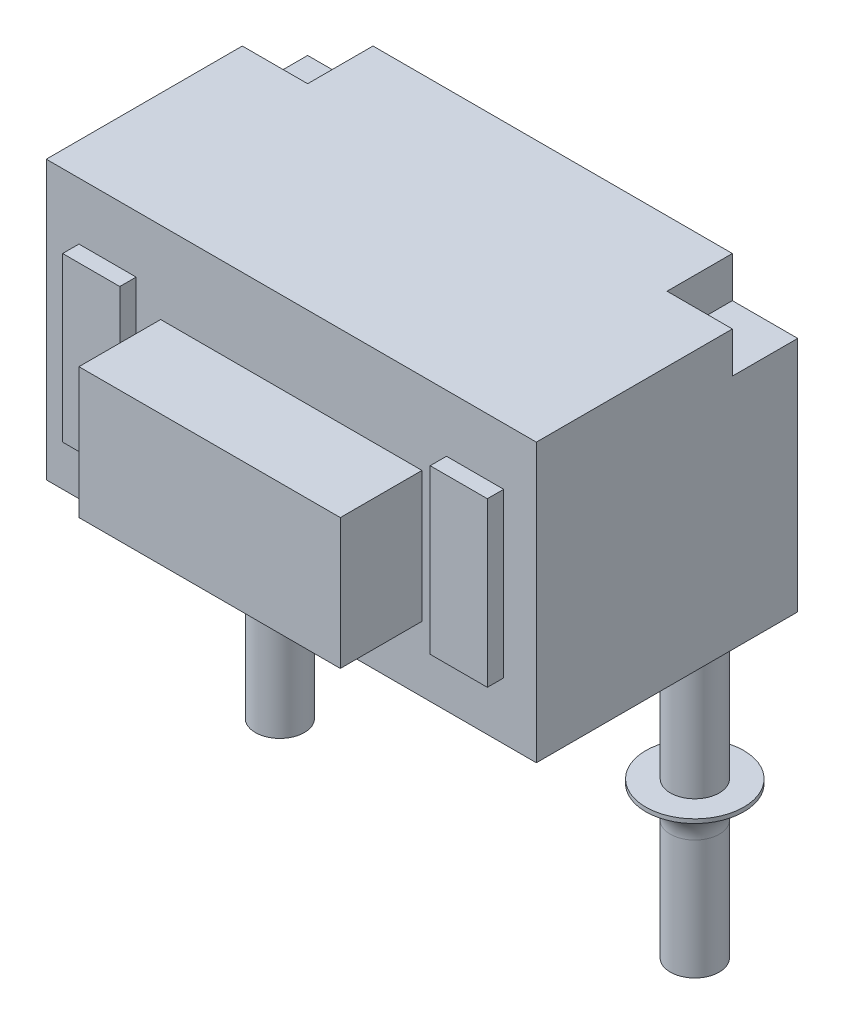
ISO-10303-21;
HEADER;
FILE_DESCRIPTION(('STEP AP214'),'2;1');
FILE_NAME('part.step','',(''),(''),'','','');
FILE_SCHEMA(('AUTOMOTIVE_DESIGN { 1 0 10303 214 1 1 1 1 }'));
ENDSEC;
DATA;
#1=APPLICATION_CONTEXT('core data for automotive mechanical design processes');
#2=APPLICATION_PROTOCOL_DEFINITION('international standard','automotive_design',2000,#1);
#3=PRODUCT_CONTEXT('',#1,'mechanical');
#4=PRODUCT('Part','Part','',(#3));
#5=PRODUCT_RELATED_PRODUCT_CATEGORY('part','',(#4));
#6=PRODUCT_DEFINITION_FORMATION('','',#4);
#7=PRODUCT_DEFINITION_CONTEXT('part definition',#1,'design');
#8=PRODUCT_DEFINITION('design','',#6,#7);
#9=PRODUCT_DEFINITION_SHAPE('','',#8);
#10=(LENGTH_UNIT() NAMED_UNIT(*) SI_UNIT(.MILLI.,.METRE.));
#11=(NAMED_UNIT(*) PLANE_ANGLE_UNIT() SI_UNIT($,.RADIAN.));
#12=(NAMED_UNIT(*) SI_UNIT($,.STERADIAN.) SOLID_ANGLE_UNIT());
#13=UNCERTAINTY_MEASURE_WITH_UNIT(LENGTH_MEASURE(1.E-05),#10,'distance_accuracy_value','');
#14=(GEOMETRIC_REPRESENTATION_CONTEXT(3) GLOBAL_UNCERTAINTY_ASSIGNED_CONTEXT((#13)) GLOBAL_UNIT_ASSIGNED_CONTEXT((#10,
#11,#12)) REPRESENTATION_CONTEXT('',''));
#15=CARTESIAN_POINT('',(0.,0.,0.));
#16=DIRECTION('',(0.,0.,1.));
#17=DIRECTION('',(1.,0.,0.));
#18=AXIS2_PLACEMENT_3D('',#15,#16,#17);
#19=CARTESIAN_POINT('',(-2.54,-3.5,-0.799999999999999));
#20=DIRECTION('',(0.,1.,0.));
#21=DIRECTION('',(0.,0.,1.));
#22=AXIS2_PLACEMENT_3D('',#19,#20,#21);
#23=CYLINDRICAL_SURFACE('',#22,0.3);
#24=CARTESIAN_POINT('',(-2.54,0.,-0.799999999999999));
#25=DIRECTION('',(0.,-1.,0.));
#26=DIRECTION('',(0.,0.,-1.));
#27=AXIS2_PLACEMENT_3D('',#24,#25,#26);
#28=CIRCLE('',#27,0.3);
#29=CARTESIAN_POINT('',(-2.54,0.,-1.1));
#30=VERTEX_POINT('',#29);
#31=EDGE_CURVE('E211',#30,#30,#28,.T.);
#32=ORIENTED_EDGE('',*,*,#31,.T.);
#33=EDGE_LOOP('',(#32));
#34=FACE_BOUND('',#33,.T.);
#35=CARTESIAN_POINT('',(-2.54,-1.6,-0.799999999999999));
#36=DIRECTION('',(0.,-1.,0.));
#37=DIRECTION('',(0.,0.,-1.));
#38=AXIS2_PLACEMENT_3D('',#35,#36,#37);
#39=CIRCLE('',#38,0.3);
#40=CARTESIAN_POINT('',(-2.54,-1.6,-1.1));
#41=VERTEX_POINT('',#40);
#42=EDGE_CURVE('E371',#41,#41,#39,.T.);
#43=ORIENTED_EDGE('',*,*,#42,.F.);
#44=EDGE_LOOP('',(#43));
#45=FACE_BOUND('',#44,.T.);
#46=ADVANCED_FACE('F35',(#34,#45),#23,.T.);
#47=CARTESIAN_POINT('',(2.54,-3.5,-0.799999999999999));
#48=DIRECTION('',(0.,1.,0.));
#49=DIRECTION('',(0.,0.,1.));
#50=AXIS2_PLACEMENT_3D('',#47,#48,#49);
#51=CYLINDRICAL_SURFACE('',#50,0.3);
#52=CARTESIAN_POINT('',(2.54,0.,-0.799999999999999));
#53=DIRECTION('',(0.,-1.,0.));
#54=DIRECTION('',(0.,0.,-1.));
#55=AXIS2_PLACEMENT_3D('',#52,#53,#54);
#56=CIRCLE('',#55,0.3);
#57=CARTESIAN_POINT('',(2.54,0.,-1.1));
#58=VERTEX_POINT('',#57);
#59=EDGE_CURVE('E552',#58,#58,#56,.T.);
#60=ORIENTED_EDGE('',*,*,#59,.T.);
#61=EDGE_LOOP('',(#60));
#62=FACE_BOUND('',#61,.T.);
#63=CARTESIAN_POINT('',(2.54,-1.6,-0.799999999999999));
#64=DIRECTION('',(0.,-1.,0.));
#65=DIRECTION('',(0.,0.,-1.));
#66=AXIS2_PLACEMENT_3D('',#63,#64,#65);
#67=CIRCLE('',#66,0.3);
#68=CARTESIAN_POINT('',(2.54,-1.6,-1.1));
#69=VERTEX_POINT('',#68);
#70=EDGE_CURVE('E368',#69,#69,#67,.T.);
#71=ORIENTED_EDGE('',*,*,#70,.F.);
#72=EDGE_LOOP('',(#71));
#73=FACE_BOUND('',#72,.T.);
#74=ADVANCED_FACE('F394',(#62,#73),#51,.T.);
#75=CARTESIAN_POINT('',(0.,0.,0.));
#76=DIRECTION('',(0.,-1.,0.));
#77=DIRECTION('',(0.,0.,-1.));
#78=AXIS2_PLACEMENT_3D('',#75,#76,#77);
#79=PLANE('',#78);
#80=ORIENTED_EDGE('',*,*,#31,.F.);
#81=EDGE_LOOP('',(#80));
#82=FACE_BOUND('',#81,.T.);
#83=DIRECTION('',(0.,0.,-1.));
#84=VECTOR('',#83,1.);
#85=CARTESIAN_POINT('',(3.,0.,1.6));
#86=LINE('',#85,#84);
#87=CARTESIAN_POINT('',(3.,0.,1.6));
#88=VERTEX_POINT('',#87);
#89=CARTESIAN_POINT('',(3.,0.,-1.6));
#90=VERTEX_POINT('',#89);
#91=EDGE_CURVE('E336',#88,#90,#86,.T.);
#92=ORIENTED_EDGE('',*,*,#91,.F.);
#93=DIRECTION('',(1.,0.,0.));
#94=VECTOR('',#93,1.);
#95=CARTESIAN_POINT('',(-3.,0.,1.6));
#96=LINE('',#95,#94);
#97=CARTESIAN_POINT('',(-3.,0.,1.6));
#98=VERTEX_POINT('',#97);
#99=EDGE_CURVE('E344',#98,#88,#96,.T.);
#100=ORIENTED_EDGE('',*,*,#99,.F.);
#101=DIRECTION('',(0.,0.,1.));
#102=VECTOR('',#101,1.);
#103=CARTESIAN_POINT('',(-3.,0.,1.6));
#104=LINE('',#103,#102);
#105=CARTESIAN_POINT('',(-3.,0.,-1.6));
#106=VERTEX_POINT('',#105);
#107=EDGE_CURVE('E356',#106,#98,#104,.T.);
#108=ORIENTED_EDGE('',*,*,#107,.F.);
#109=DIRECTION('',(-1.,0.,0.));
#110=VECTOR('',#109,1.);
#111=CARTESIAN_POINT('',(-3.,0.,-1.6));
#112=LINE('',#111,#110);
#113=EDGE_CURVE('E353',#90,#106,#112,.T.);
#114=ORIENTED_EDGE('',*,*,#113,.F.);
#115=EDGE_LOOP('',(#92,#100,#108,#114));
#116=FACE_BOUND('',#115,.T.);
#117=ORIENTED_EDGE('',*,*,#59,.F.);
#118=EDGE_LOOP('',(#117));
#119=FACE_BOUND('',#118,.T.);
#120=ADVANCED_FACE('F399',(#82,#116,#119),#79,.T.);
#121=CARTESIAN_POINT('',(-3.,3.4,1.6));
#122=DIRECTION('',(0.,0.,-1.));
#123=DIRECTION('',(-1.,0.,0.));
#124=AXIS2_PLACEMENT_3D('',#121,#122,#123);
#125=PLANE('',#124);
#126=DIRECTION('',(0.,-1.,0.));
#127=VECTOR('',#126,1.);
#128=CARTESIAN_POINT('',(-1.6,2.4,1.6));
#129=LINE('',#128,#127);
#130=CARTESIAN_POINT('',(-1.6,2.4,1.6));
#131=VERTEX_POINT('',#130);
#132=CARTESIAN_POINT('',(-1.6,0.8,1.6));
#133=VERTEX_POINT('',#132);
#134=EDGE_CURVE('E245',#131,#133,#129,.T.);
#135=ORIENTED_EDGE('',*,*,#134,.F.);
#136=DIRECTION('',(-1.,0.,0.));
#137=VECTOR('',#136,1.);
#138=CARTESIAN_POINT('',(-1.6,2.4,1.6));
#139=LINE('',#138,#137);
#140=CARTESIAN_POINT('',(1.6,2.4,1.6));
#141=VERTEX_POINT('',#140);
#142=EDGE_CURVE('E189',#141,#131,#139,.T.);
#143=ORIENTED_EDGE('',*,*,#142,.F.);
#144=DIRECTION('',(0.,1.,0.));
#145=VECTOR('',#144,1.);
#146=CARTESIAN_POINT('',(1.6,2.4,1.6));
#147=LINE('',#146,#145);
#148=CARTESIAN_POINT('',(1.6,0.8,1.6));
#149=VERTEX_POINT('',#148);
#150=EDGE_CURVE('E250',#149,#141,#147,.T.);
#151=ORIENTED_EDGE('',*,*,#150,.F.);
#152=DIRECTION('',(1.,0.,0.));
#153=VECTOR('',#152,1.);
#154=CARTESIAN_POINT('',(-1.6,0.8,1.6));
#155=LINE('',#154,#153);
#156=EDGE_CURVE('E247',#133,#149,#155,.T.);
#157=ORIENTED_EDGE('',*,*,#156,.F.);
#158=EDGE_LOOP('',(#135,#143,#151,#157));
#159=FACE_BOUND('',#158,.T.);
#160=ORIENTED_EDGE('',*,*,#99,.T.);
#161=DIRECTION('',(0.,-1.,0.));
#162=VECTOR('',#161,1.);
#163=CARTESIAN_POINT('',(3.,3.4,1.6));
#164=LINE('',#163,#162);
#165=CARTESIAN_POINT('',(3.,3.4,1.6));
#166=VERTEX_POINT('',#165);
#167=EDGE_CURVE('E350',#166,#88,#164,.T.);
#168=ORIENTED_EDGE('',*,*,#167,.F.);
#169=DIRECTION('',(1.,0.,0.));
#170=VECTOR('',#169,1.);
#171=CARTESIAN_POINT('',(-3.,3.4,1.6));
#172=LINE('',#171,#170);
#173=CARTESIAN_POINT('',(-3.,3.4,1.6));
#174=VERTEX_POINT('',#173);
#175=EDGE_CURVE('E348',#174,#166,#172,.T.);
#176=ORIENTED_EDGE('',*,*,#175,.F.);
#177=DIRECTION('',(0.,-1.,0.));
#178=VECTOR('',#177,1.);
#179=CARTESIAN_POINT('',(-3.,3.4,1.6));
#180=LINE('',#179,#178);
#181=EDGE_CURVE('E361',#174,#98,#180,.T.);
#182=ORIENTED_EDGE('',*,*,#181,.T.);
#183=EDGE_LOOP('',(#160,#168,#176,#182));
#184=FACE_BOUND('',#183,.T.);
#185=DIRECTION('',(0.,-1.,0.));
#186=VECTOR('',#185,1.);
#187=CARTESIAN_POINT('',(-2.6,2.7,1.6));
#188=LINE('',#187,#186);
#189=CARTESIAN_POINT('',(-2.6,2.7,1.6));
#190=VERTEX_POINT('',#189);
#191=CARTESIAN_POINT('',(-2.6,0.7,1.6));
#192=VERTEX_POINT('',#191);
#193=EDGE_CURVE('E259',#190,#192,#188,.T.);
#194=ORIENTED_EDGE('',*,*,#193,.F.);
#195=DIRECTION('',(-1.,0.,0.));
#196=VECTOR('',#195,1.);
#197=CARTESIAN_POINT('',(-2.6,2.7,1.6));
#198=LINE('',#197,#196);
#199=CARTESIAN_POINT('',(-1.9,2.7,1.6));
#200=VERTEX_POINT('',#199);
#201=EDGE_CURVE('E264',#200,#190,#198,.T.);
#202=ORIENTED_EDGE('',*,*,#201,.F.);
#203=DIRECTION('',(0.,1.,0.));
#204=VECTOR('',#203,1.);
#205=CARTESIAN_POINT('',(-1.9,2.7,1.6));
#206=LINE('',#205,#204);
#207=CARTESIAN_POINT('',(-1.9,0.7,1.6));
#208=VERTEX_POINT('',#207);
#209=EDGE_CURVE('E276',#208,#200,#206,.T.);
#210=ORIENTED_EDGE('',*,*,#209,.F.);
#211=DIRECTION('',(1.,0.,0.));
#212=VECTOR('',#211,1.);
#213=CARTESIAN_POINT('',(-2.6,0.7,1.6));
#214=LINE('',#213,#212);
#215=EDGE_CURVE('E273',#192,#208,#214,.T.);
#216=ORIENTED_EDGE('',*,*,#215,.F.);
#217=EDGE_LOOP('',(#194,#202,#210,#216));
#218=FACE_BOUND('',#217,.T.);
#219=DIRECTION('',(0.,-1.,0.));
#220=VECTOR('',#219,1.);
#221=CARTESIAN_POINT('',(1.9,2.7,1.6));
#222=LINE('',#221,#220);
#223=CARTESIAN_POINT('',(1.9,2.7,1.6));
#224=VERTEX_POINT('',#223);
#225=CARTESIAN_POINT('',(1.9,0.7,1.6));
#226=VERTEX_POINT('',#225);
#227=EDGE_CURVE('E217',#224,#226,#222,.T.);
#228=ORIENTED_EDGE('',*,*,#227,.F.);
#229=DIRECTION('',(-1.,0.,0.));
#230=VECTOR('',#229,1.);
#231=CARTESIAN_POINT('',(1.9,2.7,1.6));
#232=LINE('',#231,#230);
#233=CARTESIAN_POINT('',(2.6,2.7,1.6));
#234=VERTEX_POINT('',#233);
#235=EDGE_CURVE('E222',#234,#224,#232,.T.);
#236=ORIENTED_EDGE('',*,*,#235,.F.);
#237=DIRECTION('',(0.,1.,0.));
#238=VECTOR('',#237,1.);
#239=CARTESIAN_POINT('',(2.6,2.7,1.6));
#240=LINE('',#239,#238);
#241=CARTESIAN_POINT('',(2.6,0.7,1.6));
#242=VERTEX_POINT('',#241);
#243=EDGE_CURVE('E55',#242,#234,#240,.T.);
#244=ORIENTED_EDGE('',*,*,#243,.F.);
#245=DIRECTION('',(1.,0.,0.));
#246=VECTOR('',#245,1.);
#247=CARTESIAN_POINT('',(1.9,0.7,1.6));
#248=LINE('',#247,#246);
#249=EDGE_CURVE('E50',#226,#242,#248,.T.);
#250=ORIENTED_EDGE('',*,*,#249,.F.);
#251=EDGE_LOOP('',(#228,#236,#244,#250));
#252=FACE_BOUND('',#251,.T.);
#253=ADVANCED_FACE('F492',(#159,#184,#218,#252),#125,.F.);
#254=CARTESIAN_POINT('',(3.,3.4,1.6));
#255=DIRECTION('',(-1.,0.,0.));
#256=DIRECTION('',(0.,0.,1.));
#257=AXIS2_PLACEMENT_3D('',#254,#255,#256);
#258=PLANE('',#257);
#259=DIRECTION('',(0.,0.,-1.));
#260=VECTOR('',#259,1.);
#261=CARTESIAN_POINT('',(3.,2.9,-1.6));
#262=LINE('',#261,#260);
#263=CARTESIAN_POINT('',(3.,2.9,-0.799999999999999));
#264=VERTEX_POINT('',#263);
#265=CARTESIAN_POINT('',(3.,2.9,-1.6));
#266=VERTEX_POINT('',#265);
#267=EDGE_CURVE('E293',#264,#266,#262,.T.);
#268=ORIENTED_EDGE('',*,*,#267,.F.);
#269=DIRECTION('',(0.,1.,0.));
#270=VECTOR('',#269,1.);
#271=CARTESIAN_POINT('',(3.,2.9,-0.799999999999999));
#272=LINE('',#271,#270);
#273=CARTESIAN_POINT('',(3.,3.4,-0.799999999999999));
#274=VERTEX_POINT('',#273);
#275=EDGE_CURVE('E309',#264,#274,#272,.T.);
#276=ORIENTED_EDGE('',*,*,#275,.T.);
#277=DIRECTION('',(0.,0.,-1.));
#278=VECTOR('',#277,1.);
#279=CARTESIAN_POINT('',(3.,3.4,1.6));
#280=LINE('',#279,#278);
#281=EDGE_CURVE('E340',#166,#274,#280,.T.);
#282=ORIENTED_EDGE('',*,*,#281,.F.);
#283=ORIENTED_EDGE('',*,*,#167,.T.);
#284=ORIENTED_EDGE('',*,*,#91,.T.);
#285=DIRECTION('',(0.,-1.,0.));
#286=VECTOR('',#285,1.);
#287=CARTESIAN_POINT('',(3.,3.4,-1.6));
#288=LINE('',#287,#286);
#289=EDGE_CURVE('E366',#266,#90,#288,.T.);
#290=ORIENTED_EDGE('',*,*,#289,.F.);
#291=EDGE_LOOP('',(#268,#276,#282,#283,#284,#290));
#292=FACE_BOUND('',#291,.T.);
#293=ADVANCED_FACE('F496',(#292),#258,.F.);
#294=CARTESIAN_POINT('',(-3.,3.4,-1.6));
#295=DIRECTION('',(0.,0.,1.));
#296=DIRECTION('',(1.,0.,0.));
#297=AXIS2_PLACEMENT_3D('',#294,#295,#296);
#298=PLANE('',#297);
#299=DIRECTION('',(-1.,0.,0.));
#300=VECTOR('',#299,1.);
#301=CARTESIAN_POINT('',(-3.,3.4,-1.6));
#302=LINE('',#301,#300);
#303=CARTESIAN_POINT('',(2.2,3.4,-1.6));
#304=VERTEX_POINT('',#303);
#305=CARTESIAN_POINT('',(-2.2,3.4,-1.6));
#306=VERTEX_POINT('',#305);
#307=EDGE_CURVE('E343',#304,#306,#302,.T.);
#308=ORIENTED_EDGE('',*,*,#307,.F.);
#309=DIRECTION('',(0.,1.,0.));
#310=VECTOR('',#309,1.);
#311=CARTESIAN_POINT('',(2.2,2.9,-1.6));
#312=LINE('',#311,#310);
#313=CARTESIAN_POINT('',(2.2,2.9,-1.6));
#314=VERTEX_POINT('',#313);
#315=EDGE_CURVE('E305',#314,#304,#312,.T.);
#316=ORIENTED_EDGE('',*,*,#315,.F.);
#317=DIRECTION('',(-1.,0.,0.));
#318=VECTOR('',#317,1.);
#319=CARTESIAN_POINT('',(3.,2.9,-1.6));
#320=LINE('',#319,#318);
#321=EDGE_CURVE('E295',#266,#314,#320,.T.);
#322=ORIENTED_EDGE('',*,*,#321,.F.);
#323=ORIENTED_EDGE('',*,*,#289,.T.);
#324=ORIENTED_EDGE('',*,*,#113,.T.);
#325=DIRECTION('',(0.,-1.,0.));
#326=VECTOR('',#325,1.);
#327=CARTESIAN_POINT('',(-3.,3.4,-1.6));
#328=LINE('',#327,#326);
#329=CARTESIAN_POINT('',(-3.,2.9,-1.6));
#330=VERTEX_POINT('',#329);
#331=EDGE_CURVE('E364',#330,#106,#328,.T.);
#332=ORIENTED_EDGE('',*,*,#331,.F.);
#333=DIRECTION('',(-1.,0.,0.));
#334=VECTOR('',#333,1.);
#335=CARTESIAN_POINT('',(-3.,2.9,-1.6));
#336=LINE('',#335,#334);
#337=CARTESIAN_POINT('',(-2.2,2.9,-1.6));
#338=VERTEX_POINT('',#337);
#339=EDGE_CURVE('E326',#338,#330,#336,.T.);
#340=ORIENTED_EDGE('',*,*,#339,.F.);
#341=DIRECTION('',(0.,1.,0.));
#342=VECTOR('',#341,1.);
#343=CARTESIAN_POINT('',(-2.2,2.9,-1.6));
#344=LINE('',#343,#342);
#345=EDGE_CURVE('E333',#338,#306,#344,.T.);
#346=ORIENTED_EDGE('',*,*,#345,.T.);
#347=EDGE_LOOP('',(#308,#316,#322,#323,#324,#332,#340,#346));
#348=FACE_BOUND('',#347,.T.);
#349=ADVANCED_FACE('F500',(#348),#298,.F.);
#350=CARTESIAN_POINT('',(-3.,3.4,1.6));
#351=DIRECTION('',(1.,0.,0.));
#352=DIRECTION('',(0.,0.,-1.));
#353=AXIS2_PLACEMENT_3D('',#350,#351,#352);
#354=PLANE('',#353);
#355=DIRECTION('',(0.,0.,1.));
#356=VECTOR('',#355,1.);
#357=CARTESIAN_POINT('',(-3.,3.4,1.6));
#358=LINE('',#357,#356);
#359=CARTESIAN_POINT('',(-3.,3.4,-0.799999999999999));
#360=VERTEX_POINT('',#359);
#361=EDGE_CURVE('E346',#360,#174,#358,.T.);
#362=ORIENTED_EDGE('',*,*,#361,.F.);
#363=DIRECTION('',(0.,1.,0.));
#364=VECTOR('',#363,1.);
#365=CARTESIAN_POINT('',(-3.,2.9,-0.799999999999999));
#366=LINE('',#365,#364);
#367=CARTESIAN_POINT('',(-3.,2.9,-0.799999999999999));
#368=VERTEX_POINT('',#367);
#369=EDGE_CURVE('E328',#368,#360,#366,.T.);
#370=ORIENTED_EDGE('',*,*,#369,.F.);
#371=DIRECTION('',(0.,0.,1.));
#372=VECTOR('',#371,1.);
#373=CARTESIAN_POINT('',(-3.,2.9,-1.6));
#374=LINE('',#373,#372);
#375=EDGE_CURVE('E316',#330,#368,#374,.T.);
#376=ORIENTED_EDGE('',*,*,#375,.F.);
#377=ORIENTED_EDGE('',*,*,#331,.T.);
#378=ORIENTED_EDGE('',*,*,#107,.T.);
#379=ORIENTED_EDGE('',*,*,#181,.F.);
#380=EDGE_LOOP('',(#362,#370,#376,#377,#378,#379));
#381=FACE_BOUND('',#380,.T.);
#382=ADVANCED_FACE('F488',(#381),#354,.F.);
#383=CARTESIAN_POINT('',(0.,3.4,0.));
#384=DIRECTION('',(0.,-1.,0.));
#385=DIRECTION('',(0.,0.,-1.));
#386=AXIS2_PLACEMENT_3D('',#383,#384,#385);
#387=PLANE('',#386);
#388=ORIENTED_EDGE('',*,*,#281,.T.);
#389=DIRECTION('',(1.,0.,0.));
#390=VECTOR('',#389,1.);
#391=CARTESIAN_POINT('',(3.,3.4,-0.799999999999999));
#392=LINE('',#391,#390);
#393=CARTESIAN_POINT('',(2.2,3.4,-0.799999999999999));
#394=VERTEX_POINT('',#393);
#395=EDGE_CURVE('E296',#394,#274,#392,.T.);
#396=ORIENTED_EDGE('',*,*,#395,.F.);
#397=DIRECTION('',(0.,0.,1.));
#398=VECTOR('',#397,1.);
#399=CARTESIAN_POINT('',(2.2,3.4,-1.6));
#400=LINE('',#399,#398);
#401=EDGE_CURVE('E292',#304,#394,#400,.T.);
#402=ORIENTED_EDGE('',*,*,#401,.F.);
#403=ORIENTED_EDGE('',*,*,#307,.T.);
#404=DIRECTION('',(0.,0.,-1.));
#405=VECTOR('',#404,1.);
#406=CARTESIAN_POINT('',(-2.2,3.4,-1.6));
#407=LINE('',#406,#405);
#408=CARTESIAN_POINT('',(-2.2,3.4,-0.799999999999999));
#409=VERTEX_POINT('',#408);
#410=EDGE_CURVE('E320',#409,#306,#407,.T.);
#411=ORIENTED_EDGE('',*,*,#410,.F.);
#412=DIRECTION('',(1.,0.,0.));
#413=VECTOR('',#412,1.);
#414=CARTESIAN_POINT('',(-3.,3.4,-0.799999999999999));
#415=LINE('',#414,#413);
#416=EDGE_CURVE('E312',#360,#409,#415,.T.);
#417=ORIENTED_EDGE('',*,*,#416,.F.);
#418=ORIENTED_EDGE('',*,*,#361,.T.);
#419=ORIENTED_EDGE('',*,*,#175,.T.);
#420=EDGE_LOOP('',(#388,#396,#402,#403,#411,#417,#418,#419));
#421=FACE_BOUND('',#420,.T.);
#422=ADVANCED_FACE('F481',(#421),#387,.F.);
#423=CARTESIAN_POINT('',(-2.2,2.9,-1.6));
#424=DIRECTION('',(1.,0.,0.));
#425=DIRECTION('',(0.,0.,-1.));
#426=AXIS2_PLACEMENT_3D('',#423,#424,#425);
#427=PLANE('',#426);
#428=ORIENTED_EDGE('',*,*,#410,.T.);
#429=ORIENTED_EDGE('',*,*,#345,.F.);
#430=DIRECTION('',(0.,0.,-1.));
#431=VECTOR('',#430,1.);
#432=CARTESIAN_POINT('',(-2.2,2.9,-1.6));
#433=LINE('',#432,#431);
#434=CARTESIAN_POINT('',(-2.2,2.9,-0.799999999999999));
#435=VERTEX_POINT('',#434);
#436=EDGE_CURVE('E323',#435,#338,#433,.T.);
#437=ORIENTED_EDGE('',*,*,#436,.F.);
#438=DIRECTION('',(0.,1.,0.));
#439=VECTOR('',#438,1.);
#440=CARTESIAN_POINT('',(-2.2,2.9,-0.799999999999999));
#441=LINE('',#440,#439);
#442=EDGE_CURVE('E337',#435,#409,#441,.T.);
#443=ORIENTED_EDGE('',*,*,#442,.T.);
#444=EDGE_LOOP('',(#428,#429,#437,#443));
#445=FACE_BOUND('',#444,.T.);
#446=ADVANCED_FACE('F478',(#445),#427,.F.);
#447=CARTESIAN_POINT('',(-3.,2.9,-0.799999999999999));
#448=DIRECTION('',(0.,0.,1.));
#449=DIRECTION('',(1.,0.,0.));
#450=AXIS2_PLACEMENT_3D('',#447,#448,#449);
#451=PLANE('',#450);
#452=ORIENTED_EDGE('',*,*,#416,.T.);
#453=ORIENTED_EDGE('',*,*,#442,.F.);
#454=DIRECTION('',(1.,0.,0.));
#455=VECTOR('',#454,1.);
#456=CARTESIAN_POINT('',(-3.,2.9,-0.799999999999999));
#457=LINE('',#456,#455);
#458=EDGE_CURVE('E319',#368,#435,#457,.T.);
#459=ORIENTED_EDGE('',*,*,#458,.F.);
#460=ORIENTED_EDGE('',*,*,#369,.T.);
#461=EDGE_LOOP('',(#452,#453,#459,#460));
#462=FACE_BOUND('',#461,.T.);
#463=ADVANCED_FACE('F476',(#462),#451,.F.);
#464=CARTESIAN_POINT('',(0.,2.9,0.));
#465=DIRECTION('',(0.,1.,0.));
#466=DIRECTION('',(0.,0.,1.));
#467=AXIS2_PLACEMENT_3D('',#464,#465,#466);
#468=PLANE('',#467);
#469=ORIENTED_EDGE('',*,*,#375,.T.);
#470=ORIENTED_EDGE('',*,*,#458,.T.);
#471=ORIENTED_EDGE('',*,*,#436,.T.);
#472=ORIENTED_EDGE('',*,*,#339,.T.);
#473=EDGE_LOOP('',(#469,#470,#471,#472));
#474=FACE_BOUND('',#473,.T.);
#475=ADVANCED_FACE('F469',(#474),#468,.T.);
#476=CARTESIAN_POINT('',(3.,2.9,-0.799999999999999));
#477=DIRECTION('',(0.,0.,1.));
#478=DIRECTION('',(1.,0.,0.));
#479=AXIS2_PLACEMENT_3D('',#476,#477,#478);
#480=PLANE('',#479);
#481=ORIENTED_EDGE('',*,*,#395,.T.);
#482=ORIENTED_EDGE('',*,*,#275,.F.);
#483=DIRECTION('',(1.,0.,0.));
#484=VECTOR('',#483,1.);
#485=CARTESIAN_POINT('',(3.,2.9,-0.799999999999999));
#486=LINE('',#485,#484);
#487=CARTESIAN_POINT('',(2.2,2.9,-0.799999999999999));
#488=VERTEX_POINT('',#487);
#489=EDGE_CURVE('E302',#488,#264,#486,.T.);
#490=ORIENTED_EDGE('',*,*,#489,.F.);
#491=DIRECTION('',(0.,1.,0.));
#492=VECTOR('',#491,1.);
#493=CARTESIAN_POINT('',(2.2,2.9,-0.799999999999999));
#494=LINE('',#493,#492);
#495=EDGE_CURVE('E313',#488,#394,#494,.T.);
#496=ORIENTED_EDGE('',*,*,#495,.T.);
#497=EDGE_LOOP('',(#481,#482,#490,#496));
#498=FACE_BOUND('',#497,.T.);
#499=ADVANCED_FACE('F466',(#498),#480,.F.);
#500=CARTESIAN_POINT('',(2.2,2.9,-1.6));
#501=DIRECTION('',(-1.,0.,0.));
#502=DIRECTION('',(0.,0.,1.));
#503=AXIS2_PLACEMENT_3D('',#500,#501,#502);
#504=PLANE('',#503);
#505=ORIENTED_EDGE('',*,*,#401,.T.);
#506=ORIENTED_EDGE('',*,*,#495,.F.);
#507=DIRECTION('',(0.,0.,1.));
#508=VECTOR('',#507,1.);
#509=CARTESIAN_POINT('',(2.2,2.9,-1.6));
#510=LINE('',#509,#508);
#511=EDGE_CURVE('E299',#314,#488,#510,.T.);
#512=ORIENTED_EDGE('',*,*,#511,.F.);
#513=ORIENTED_EDGE('',*,*,#315,.T.);
#514=EDGE_LOOP('',(#505,#506,#512,#513));
#515=FACE_BOUND('',#514,.T.);
#516=ADVANCED_FACE('F464',(#515),#504,.F.);
#517=CARTESIAN_POINT('',(0.,2.9,0.));
#518=DIRECTION('',(0.,-1.,0.));
#519=DIRECTION('',(0.,0.,-1.));
#520=AXIS2_PLACEMENT_3D('',#517,#518,#519);
#521=PLANE('',#520);
#522=ORIENTED_EDGE('',*,*,#267,.T.);
#523=ORIENTED_EDGE('',*,*,#321,.T.);
#524=ORIENTED_EDGE('',*,*,#511,.T.);
#525=ORIENTED_EDGE('',*,*,#489,.T.);
#526=EDGE_LOOP('',(#522,#523,#524,#525));
#527=FACE_BOUND('',#526,.T.);
#528=ADVANCED_FACE('F460',(#527),#521,.F.);
#529=CARTESIAN_POINT('',(-2.6,2.7,1.8));
#530=DIRECTION('',(1.,0.,0.));
#531=DIRECTION('',(0.,1.,0.));
#532=AXIS2_PLACEMENT_3D('',#529,#530,#531);
#533=PLANE('',#532);
#534=ORIENTED_EDGE('',*,*,#193,.T.);
#535=DIRECTION('',(0.,0.,-1.));
#536=VECTOR('',#535,1.);
#537=CARTESIAN_POINT('',(-2.6,0.7,1.8));
#538=LINE('',#537,#536);
#539=CARTESIAN_POINT('',(-2.6,0.7,1.8));
#540=VERTEX_POINT('',#539);
#541=EDGE_CURVE('E289',#540,#192,#538,.T.);
#542=ORIENTED_EDGE('',*,*,#541,.F.);
#543=DIRECTION('',(0.,-1.,0.));
#544=VECTOR('',#543,1.);
#545=CARTESIAN_POINT('',(-2.6,2.7,1.8));
#546=LINE('',#545,#544);
#547=CARTESIAN_POINT('',(-2.6,2.7,1.8));
#548=VERTEX_POINT('',#547);
#549=EDGE_CURVE('E260',#548,#540,#546,.T.);
#550=ORIENTED_EDGE('',*,*,#549,.F.);
#551=DIRECTION('',(0.,0.,-1.));
#552=VECTOR('',#551,1.);
#553=CARTESIAN_POINT('',(-2.6,2.7,1.8));
#554=LINE('',#553,#552);
#555=EDGE_CURVE('E270',#548,#190,#554,.T.);
#556=ORIENTED_EDGE('',*,*,#555,.T.);
#557=EDGE_LOOP('',(#534,#542,#550,#556));
#558=FACE_BOUND('',#557,.T.);
#559=ADVANCED_FACE('F456',(#558),#533,.F.);
#560=CARTESIAN_POINT('',(-2.6,0.7,1.8));
#561=DIRECTION('',(0.,1.,0.));
#562=DIRECTION('',(-1.,0.,0.));
#563=AXIS2_PLACEMENT_3D('',#560,#561,#562);
#564=PLANE('',#563);
#565=ORIENTED_EDGE('',*,*,#215,.T.);
#566=DIRECTION('',(0.,0.,-1.));
#567=VECTOR('',#566,1.);
#568=CARTESIAN_POINT('',(-1.9,0.7,1.8));
#569=LINE('',#568,#567);
#570=CARTESIAN_POINT('',(-1.9,0.7,1.8));
#571=VERTEX_POINT('',#570);
#572=EDGE_CURVE('E286',#571,#208,#569,.T.);
#573=ORIENTED_EDGE('',*,*,#572,.F.);
#574=DIRECTION('',(1.,0.,0.));
#575=VECTOR('',#574,1.);
#576=CARTESIAN_POINT('',(-2.6,0.7,1.8));
#577=LINE('',#576,#575);
#578=EDGE_CURVE('E263',#540,#571,#577,.T.);
#579=ORIENTED_EDGE('',*,*,#578,.F.);
#580=ORIENTED_EDGE('',*,*,#541,.T.);
#581=EDGE_LOOP('',(#565,#573,#579,#580));
#582=FACE_BOUND('',#581,.T.);
#583=ADVANCED_FACE('F452',(#582),#564,.F.);
#584=CARTESIAN_POINT('',(-1.9,2.7,1.8));
#585=DIRECTION('',(-1.,0.,0.));
#586=DIRECTION('',(0.,-1.,0.));
#587=AXIS2_PLACEMENT_3D('',#584,#585,#586);
#588=PLANE('',#587);
#589=ORIENTED_EDGE('',*,*,#209,.T.);
#590=DIRECTION('',(0.,0.,-1.));
#591=VECTOR('',#590,1.);
#592=CARTESIAN_POINT('',(-1.9,2.7,1.8));
#593=LINE('',#592,#591);
#594=CARTESIAN_POINT('',(-1.9,2.7,1.8));
#595=VERTEX_POINT('',#594);
#596=EDGE_CURVE('E283',#595,#200,#593,.T.);
#597=ORIENTED_EDGE('',*,*,#596,.F.);
#598=DIRECTION('',(0.,1.,0.));
#599=VECTOR('',#598,1.);
#600=CARTESIAN_POINT('',(-1.9,2.7,1.8));
#601=LINE('',#600,#599);
#602=EDGE_CURVE('E266',#571,#595,#601,.T.);
#603=ORIENTED_EDGE('',*,*,#602,.F.);
#604=ORIENTED_EDGE('',*,*,#572,.T.);
#605=EDGE_LOOP('',(#589,#597,#603,#604));
#606=FACE_BOUND('',#605,.T.);
#607=ADVANCED_FACE('F448',(#606),#588,.F.);
#608=CARTESIAN_POINT('',(-2.6,2.7,1.8));
#609=DIRECTION('',(0.,-1.,0.));
#610=DIRECTION('',(0.,0.,-1.));
#611=AXIS2_PLACEMENT_3D('',#608,#609,#610);
#612=PLANE('',#611);
#613=ORIENTED_EDGE('',*,*,#201,.T.);
#614=ORIENTED_EDGE('',*,*,#555,.F.);
#615=DIRECTION('',(-1.,0.,0.));
#616=VECTOR('',#615,1.);
#617=CARTESIAN_POINT('',(-2.6,2.7,1.8));
#618=LINE('',#617,#616);
#619=EDGE_CURVE('E268',#595,#548,#618,.T.);
#620=ORIENTED_EDGE('',*,*,#619,.F.);
#621=ORIENTED_EDGE('',*,*,#596,.T.);
#622=EDGE_LOOP('',(#613,#614,#620,#621));
#623=FACE_BOUND('',#622,.T.);
#624=ADVANCED_FACE('F444',(#623),#612,.F.);
#625=CARTESIAN_POINT('',(0.,0.,1.8));
#626=DIRECTION('',(0.,0.,1.));
#627=DIRECTION('',(1.,0.,0.));
#628=AXIS2_PLACEMENT_3D('',#625,#626,#627);
#629=PLANE('',#628);
#630=ORIENTED_EDGE('',*,*,#549,.T.);
#631=ORIENTED_EDGE('',*,*,#578,.T.);
#632=ORIENTED_EDGE('',*,*,#602,.T.);
#633=ORIENTED_EDGE('',*,*,#619,.T.);
#634=EDGE_LOOP('',(#630,#631,#632,#633));
#635=FACE_BOUND('',#634,.T.);
#636=ADVANCED_FACE('F441',(#635),#629,.T.);
#637=CARTESIAN_POINT('',(-1.6,2.4,1.8));
#638=DIRECTION('',(1.,0.,0.));
#639=DIRECTION('',(0.,1.,0.));
#640=AXIS2_PLACEMENT_3D('',#637,#638,#639);
#641=PLANE('',#640);
#642=ORIENTED_EDGE('',*,*,#134,.T.);
#643=DIRECTION('',(0.,0.,-1.));
#644=VECTOR('',#643,1.);
#645=CARTESIAN_POINT('',(-1.6,0.8,1.8));
#646=LINE('',#645,#644);
#647=CARTESIAN_POINT('',(-1.6,0.8,2.6));
#648=VERTEX_POINT('',#647);
#649=EDGE_CURVE('E198',#648,#133,#646,.T.);
#650=ORIENTED_EDGE('',*,*,#649,.F.);
#651=DIRECTION('',(0.,-1.,0.));
#652=VECTOR('',#651,1.);
#653=CARTESIAN_POINT('',(-1.6,2.4,2.6));
#654=LINE('',#653,#652);
#655=CARTESIAN_POINT('',(-1.6,2.4,2.6));
#656=VERTEX_POINT('',#655);
#657=EDGE_CURVE('E195',#656,#648,#654,.T.);
#658=ORIENTED_EDGE('',*,*,#657,.F.);
#659=DIRECTION('',(0.,0.,-1.));
#660=VECTOR('',#659,1.);
#661=CARTESIAN_POINT('',(-1.6,2.4,1.8));
#662=LINE('',#661,#660);
#663=EDGE_CURVE('E183',#656,#131,#662,.T.);
#664=ORIENTED_EDGE('',*,*,#663,.T.);
#665=EDGE_LOOP('',(#642,#650,#658,#664));
#666=FACE_BOUND('',#665,.T.);
#667=ADVANCED_FACE('F196',(#666),#641,.F.);
#668=CARTESIAN_POINT('',(-1.6,0.8,1.8));
#669=DIRECTION('',(0.,1.,0.));
#670=DIRECTION('',(0.,0.,1.));
#671=AXIS2_PLACEMENT_3D('',#668,#669,#670);
#672=PLANE('',#671);
#673=ORIENTED_EDGE('',*,*,#156,.T.);
#674=DIRECTION('',(0.,0.,-1.));
#675=VECTOR('',#674,1.);
#676=CARTESIAN_POINT('',(1.6,0.8,1.8));
#677=LINE('',#676,#675);
#678=CARTESIAN_POINT('',(1.6,0.8,2.6));
#679=VERTEX_POINT('',#678);
#680=EDGE_CURVE('E255',#679,#149,#677,.T.);
#681=ORIENTED_EDGE('',*,*,#680,.F.);
#682=DIRECTION('',(1.,0.,0.));
#683=VECTOR('',#682,1.);
#684=CARTESIAN_POINT('',(-1.6,0.8,2.6));
#685=LINE('',#684,#683);
#686=EDGE_CURVE('E202',#648,#679,#685,.T.);
#687=ORIENTED_EDGE('',*,*,#686,.F.);
#688=ORIENTED_EDGE('',*,*,#649,.T.);
#689=EDGE_LOOP('',(#673,#681,#687,#688));
#690=FACE_BOUND('',#689,.T.);
#691=ADVANCED_FACE('F434',(#690),#672,.F.);
#692=CARTESIAN_POINT('',(1.6,2.4,1.8));
#693=DIRECTION('',(-1.,0.,0.));
#694=DIRECTION('',(0.,-1.,0.));
#695=AXIS2_PLACEMENT_3D('',#692,#693,#694);
#696=PLANE('',#695);
#697=ORIENTED_EDGE('',*,*,#150,.T.);
#698=DIRECTION('',(0.,0.,-1.));
#699=VECTOR('',#698,1.);
#700=CARTESIAN_POINT('',(1.6,2.4,1.8));
#701=LINE('',#700,#699);
#702=CARTESIAN_POINT('',(1.6,2.4,2.6));
#703=VERTEX_POINT('',#702);
#704=EDGE_CURVE('E192',#703,#141,#701,.T.);
#705=ORIENTED_EDGE('',*,*,#704,.F.);
#706=DIRECTION('',(0.,1.,0.));
#707=VECTOR('',#706,1.);
#708=CARTESIAN_POINT('',(1.6,0.8,2.6));
#709=LINE('',#708,#707);
#710=EDGE_CURVE('E207',#679,#703,#709,.T.);
#711=ORIENTED_EDGE('',*,*,#710,.F.);
#712=ORIENTED_EDGE('',*,*,#680,.T.);
#713=EDGE_LOOP('',(#697,#705,#711,#712));
#714=FACE_BOUND('',#713,.T.);
#715=ADVANCED_FACE('F431',(#714),#696,.F.);
#716=CARTESIAN_POINT('',(-1.6,2.4,1.8));
#717=DIRECTION('',(0.,-1.,0.));
#718=DIRECTION('',(0.,0.,-1.));
#719=AXIS2_PLACEMENT_3D('',#716,#717,#718);
#720=PLANE('',#719);
#721=ORIENTED_EDGE('',*,*,#142,.T.);
#722=ORIENTED_EDGE('',*,*,#663,.F.);
#723=DIRECTION('',(-1.,0.,0.));
#724=VECTOR('',#723,1.);
#725=CARTESIAN_POINT('',(1.6,2.4,2.6));
#726=LINE('',#725,#724);
#727=EDGE_CURVE('E188',#703,#656,#726,.T.);
#728=ORIENTED_EDGE('',*,*,#727,.F.);
#729=ORIENTED_EDGE('',*,*,#704,.T.);
#730=EDGE_LOOP('',(#721,#722,#728,#729));
#731=FACE_BOUND('',#730,.T.);
#732=ADVANCED_FACE('F185',(#731),#720,.F.);
#733=CARTESIAN_POINT('',(1.9,2.7,1.8));
#734=DIRECTION('',(1.,0.,0.));
#735=DIRECTION('',(0.,1.,0.));
#736=AXIS2_PLACEMENT_3D('',#733,#734,#735);
#737=PLANE('',#736);
#738=ORIENTED_EDGE('',*,*,#227,.T.);
#739=DIRECTION('',(0.,0.,-1.));
#740=VECTOR('',#739,1.);
#741=CARTESIAN_POINT('',(1.9,0.7,1.8));
#742=LINE('',#741,#740);
#743=CARTESIAN_POINT('',(1.9,0.7,1.8));
#744=VERTEX_POINT('',#743);
#745=EDGE_CURVE('E243',#744,#226,#742,.T.);
#746=ORIENTED_EDGE('',*,*,#745,.F.);
#747=DIRECTION('',(0.,-1.,0.));
#748=VECTOR('',#747,1.);
#749=CARTESIAN_POINT('',(1.9,2.7,1.8));
#750=LINE('',#749,#748);
#751=CARTESIAN_POINT('',(1.9,2.7,1.8));
#752=VERTEX_POINT('',#751);
#753=EDGE_CURVE('E218',#752,#744,#750,.T.);
#754=ORIENTED_EDGE('',*,*,#753,.F.);
#755=DIRECTION('',(0.,0.,-1.));
#756=VECTOR('',#755,1.);
#757=CARTESIAN_POINT('',(1.9,2.7,1.8));
#758=LINE('',#757,#756);
#759=EDGE_CURVE('E228',#752,#224,#758,.T.);
#760=ORIENTED_EDGE('',*,*,#759,.T.);
#761=EDGE_LOOP('',(#738,#746,#754,#760));
#762=FACE_BOUND('',#761,.T.);
#763=ADVANCED_FACE('F424',(#762),#737,.F.);
#764=CARTESIAN_POINT('',(1.9,0.7,1.8));
#765=DIRECTION('',(0.,1.,0.));
#766=DIRECTION('',(-1.,0.,0.));
#767=AXIS2_PLACEMENT_3D('',#764,#765,#766);
#768=PLANE('',#767);
#769=ORIENTED_EDGE('',*,*,#249,.T.);
#770=DIRECTION('',(0.,0.,-1.));
#771=VECTOR('',#770,1.);
#772=CARTESIAN_POINT('',(2.6,0.7,1.8));
#773=LINE('',#772,#771);
#774=CARTESIAN_POINT('',(2.6,0.7,1.8));
#775=VERTEX_POINT('',#774);
#776=EDGE_CURVE('E240',#775,#242,#773,.T.);
#777=ORIENTED_EDGE('',*,*,#776,.F.);
#778=DIRECTION('',(1.,0.,0.));
#779=VECTOR('',#778,1.);
#780=CARTESIAN_POINT('',(1.9,0.7,1.8));
#781=LINE('',#780,#779);
#782=EDGE_CURVE('E221',#744,#775,#781,.T.);
#783=ORIENTED_EDGE('',*,*,#782,.F.);
#784=ORIENTED_EDGE('',*,*,#745,.T.);
#785=EDGE_LOOP('',(#769,#777,#783,#784));
#786=FACE_BOUND('',#785,.T.);
#787=ADVANCED_FACE('F420',(#786),#768,.F.);
#788=CARTESIAN_POINT('',(2.6,2.7,1.8));
#789=DIRECTION('',(-1.,0.,0.));
#790=DIRECTION('',(0.,0.,1.));
#791=AXIS2_PLACEMENT_3D('',#788,#789,#790);
#792=PLANE('',#791);
#793=ORIENTED_EDGE('',*,*,#243,.T.);
#794=DIRECTION('',(0.,0.,-1.));
#795=VECTOR('',#794,1.);
#796=CARTESIAN_POINT('',(2.6,2.7,1.8));
#797=LINE('',#796,#795);
#798=CARTESIAN_POINT('',(2.6,2.7,1.8));
#799=VERTEX_POINT('',#798);
#800=EDGE_CURVE('E237',#799,#234,#797,.T.);
#801=ORIENTED_EDGE('',*,*,#800,.F.);
#802=DIRECTION('',(0.,1.,0.));
#803=VECTOR('',#802,1.);
#804=CARTESIAN_POINT('',(2.6,2.7,1.8));
#805=LINE('',#804,#803);
#806=EDGE_CURVE('E224',#775,#799,#805,.T.);
#807=ORIENTED_EDGE('',*,*,#806,.F.);
#808=ORIENTED_EDGE('',*,*,#776,.T.);
#809=EDGE_LOOP('',(#793,#801,#807,#808));
#810=FACE_BOUND('',#809,.T.);
#811=ADVANCED_FACE('F416',(#810),#792,.F.);
#812=CARTESIAN_POINT('',(1.9,2.7,1.8));
#813=DIRECTION('',(0.,-1.,0.));
#814=DIRECTION('',(0.,0.,-1.));
#815=AXIS2_PLACEMENT_3D('',#812,#813,#814);
#816=PLANE('',#815);
#817=ORIENTED_EDGE('',*,*,#235,.T.);
#818=ORIENTED_EDGE('',*,*,#759,.F.);
#819=DIRECTION('',(-1.,0.,0.));
#820=VECTOR('',#819,1.);
#821=CARTESIAN_POINT('',(1.9,2.7,1.8));
#822=LINE('',#821,#820);
#823=EDGE_CURVE('E226',#799,#752,#822,.T.);
#824=ORIENTED_EDGE('',*,*,#823,.F.);
#825=ORIENTED_EDGE('',*,*,#800,.T.);
#826=EDGE_LOOP('',(#817,#818,#824,#825));
#827=FACE_BOUND('',#826,.T.);
#828=ADVANCED_FACE('F412',(#827),#816,.F.);
#829=CARTESIAN_POINT('',(0.,0.,1.8));
#830=DIRECTION('',(0.,0.,1.));
#831=DIRECTION('',(1.,0.,0.));
#832=AXIS2_PLACEMENT_3D('',#829,#830,#831);
#833=PLANE('',#832);
#834=ORIENTED_EDGE('',*,*,#753,.T.);
#835=ORIENTED_EDGE('',*,*,#782,.T.);
#836=ORIENTED_EDGE('',*,*,#806,.T.);
#837=ORIENTED_EDGE('',*,*,#823,.T.);
#838=EDGE_LOOP('',(#834,#835,#836,#837));
#839=FACE_BOUND('',#838,.T.);
#840=ADVANCED_FACE('F409',(#839),#833,.T.);
#841=CARTESIAN_POINT('',(0.,0.,2.6));
#842=DIRECTION('',(0.,0.,1.));
#843=DIRECTION('',(1.,0.,0.));
#844=AXIS2_PLACEMENT_3D('',#841,#842,#843);
#845=PLANE('',#844);
#846=ORIENTED_EDGE('',*,*,#727,.T.);
#847=ORIENTED_EDGE('',*,*,#657,.T.);
#848=ORIENTED_EDGE('',*,*,#686,.T.);
#849=ORIENTED_EDGE('',*,*,#710,.T.);
#850=EDGE_LOOP('',(#846,#847,#848,#849));
#851=FACE_BOUND('',#850,.T.);
#852=ADVANCED_FACE('F205',(#851),#845,.T.);
#853=CARTESIAN_POINT('',(2.54,-1.6,-0.799999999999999));
#854=DIRECTION('',(0.,-1.,0.));
#855=DIRECTION('',(0.,0.,-1.));
#856=AXIS2_PLACEMENT_3D('',#853,#854,#855);
#857=PLANE('',#856);
#858=CARTESIAN_POINT('',(2.54,-1.6,-0.799999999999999));
#859=DIRECTION('',(0.,-1.,0.));
#860=DIRECTION('',(0.,0.,-1.));
#861=AXIS2_PLACEMENT_3D('',#858,#859,#860);
#862=CIRCLE('',#861,0.6);
#863=CARTESIAN_POINT('',(2.54,-1.6,-1.4));
#864=VERTEX_POINT('',#863);
#865=EDGE_CURVE('E558',#864,#864,#862,.T.);
#866=ORIENTED_EDGE('',*,*,#865,.F.);
#867=EDGE_LOOP('',(#866));
#868=FACE_BOUND('',#867,.T.);
#869=ORIENTED_EDGE('',*,*,#70,.T.);
#870=EDGE_LOOP('',(#869));
#871=FACE_BOUND('',#870,.T.);
#872=ADVANCED_FACE('F408',(#868,#871),#857,.F.);
#873=CARTESIAN_POINT('',(2.54,-1.65,-0.799999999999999));
#874=DIRECTION('',(0.,1.,0.));
#875=DIRECTION('',(0.,0.,1.));
#876=AXIS2_PLACEMENT_3D('',#873,#874,#875);
#877=CYLINDRICAL_SURFACE('',#876,0.6);
#878=CARTESIAN_POINT('',(2.54,-1.65,-0.799999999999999));
#879=DIRECTION('',(0.,-1.,0.));
#880=DIRECTION('',(0.,0.,-1.));
#881=AXIS2_PLACEMENT_3D('',#878,#879,#880);
#882=CIRCLE('',#881,0.6);
#883=CARTESIAN_POINT('',(2.54,-1.65,-1.4));
#884=VERTEX_POINT('',#883);
#885=EDGE_CURVE('E554',#884,#884,#882,.T.);
#886=ORIENTED_EDGE('',*,*,#885,.F.);
#887=EDGE_LOOP('',(#886));
#888=FACE_BOUND('',#887,.T.);
#889=ORIENTED_EDGE('',*,*,#865,.T.);
#890=EDGE_LOOP('',(#889));
#891=FACE_BOUND('',#890,.T.);
#892=ADVANCED_FACE('F589',(#888,#891),#877,.T.);
#893=CARTESIAN_POINT('',(2.54,-3.5,-0.799999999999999));
#894=DIRECTION('',(0.,-1.,0.));
#895=DIRECTION('',(0.,0.,-1.));
#896=AXIS2_PLACEMENT_3D('',#893,#894,#895);
#897=PLANE('',#896);
#898=CARTESIAN_POINT('',(2.54,-3.5,-0.799999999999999));
#899=DIRECTION('',(0.,-1.,0.));
#900=DIRECTION('',(0.,0.,-1.));
#901=AXIS2_PLACEMENT_3D('',#898,#899,#900);
#902=CIRCLE('',#901,0.3);
#903=CARTESIAN_POINT('',(2.54,-3.5,-1.1));
#904=VERTEX_POINT('',#903);
#905=EDGE_CURVE('E553',#904,#904,#902,.T.);
#906=ORIENTED_EDGE('',*,*,#905,.T.);
#907=EDGE_LOOP('',(#906));
#908=FACE_BOUND('',#907,.T.);
#909=ADVANCED_FACE('F585',(#908),#897,.T.);
#910=CARTESIAN_POINT('',(2.54,-2.03729833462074,-0.799999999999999));
#911=DIRECTION('',(0.,1.,0.));
#912=DIRECTION('',(0.,0.,1.));
#913=AXIS2_PLACEMENT_3D('',#910,#911,#912);
#914=CIRCLE('',#913,0.3);
#915=CARTESIAN_POINT('',(2.54,-2.03729833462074,-0.499999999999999));
#916=VERTEX_POINT('',#915);
#917=EDGE_CURVE('E43',#916,#916,#914,.F.);
#918=ORIENTED_EDGE('',*,*,#917,.T.);
#919=EDGE_LOOP('',(#918));
#920=FACE_BOUND('',#919,.T.);
#921=ORIENTED_EDGE('',*,*,#905,.F.);
#922=EDGE_LOOP('',(#921));
#923=FACE_BOUND('',#922,.T.);
#924=ADVANCED_FACE('F376',(#920,#923),#51,.T.);
#925=CARTESIAN_POINT('',(-2.54,-1.6,-0.799999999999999));
#926=DIRECTION('',(0.,-1.,0.));
#927=DIRECTION('',(0.,0.,-1.));
#928=AXIS2_PLACEMENT_3D('',#925,#926,#927);
#929=PLANE('',#928);
#930=CARTESIAN_POINT('',(-2.54,-1.6,-0.799999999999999));
#931=DIRECTION('',(0.,-1.,0.));
#932=DIRECTION('',(0.,0.,-1.));
#933=AXIS2_PLACEMENT_3D('',#930,#931,#932);
#934=CIRCLE('',#933,0.6);
#935=CARTESIAN_POINT('',(-2.54,-1.6,-1.4));
#936=VERTEX_POINT('',#935);
#937=EDGE_CURVE('E564',#936,#936,#934,.T.);
#938=ORIENTED_EDGE('',*,*,#937,.F.);
#939=EDGE_LOOP('',(#938));
#940=FACE_BOUND('',#939,.T.);
#941=ORIENTED_EDGE('',*,*,#42,.T.);
#942=EDGE_LOOP('',(#941));
#943=FACE_BOUND('',#942,.T.);
#944=ADVANCED_FACE('F574',(#940,#943),#929,.F.);
#945=CARTESIAN_POINT('',(-2.54,-1.65,-0.799999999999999));
#946=DIRECTION('',(0.,1.,0.));
#947=DIRECTION('',(0.,0.,1.));
#948=AXIS2_PLACEMENT_3D('',#945,#946,#947);
#949=CYLINDRICAL_SURFACE('',#948,0.6);
#950=CARTESIAN_POINT('',(-2.54,-1.65,-0.799999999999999));
#951=DIRECTION('',(0.,-1.,0.));
#952=DIRECTION('',(0.,0.,-1.));
#953=AXIS2_PLACEMENT_3D('',#950,#951,#952);
#954=CIRCLE('',#953,0.6);
#955=CARTESIAN_POINT('',(-2.54,-1.65,-1.4));
#956=VERTEX_POINT('',#955);
#957=EDGE_CURVE('E562',#956,#956,#954,.T.);
#958=ORIENTED_EDGE('',*,*,#957,.F.);
#959=EDGE_LOOP('',(#958));
#960=FACE_BOUND('',#959,.T.);
#961=ORIENTED_EDGE('',*,*,#937,.T.);
#962=EDGE_LOOP('',(#961));
#963=FACE_BOUND('',#962,.T.);
#964=ADVANCED_FACE('F571',(#960,#963),#949,.T.);
#965=CARTESIAN_POINT('',(-2.54,-3.5,-0.799999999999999));
#966=DIRECTION('',(0.,-1.,0.));
#967=DIRECTION('',(0.,0.,-1.));
#968=AXIS2_PLACEMENT_3D('',#965,#966,#967);
#969=PLANE('',#968);
#970=CARTESIAN_POINT('',(-2.54,-3.5,-0.799999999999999));
#971=DIRECTION('',(0.,-1.,0.));
#972=DIRECTION('',(0.,0.,-1.));
#973=AXIS2_PLACEMENT_3D('',#970,#971,#972);
#974=CIRCLE('',#973,0.3);
#975=CARTESIAN_POINT('',(-2.54,-3.5,-1.1));
#976=VERTEX_POINT('',#975);
#977=EDGE_CURVE('E208',#976,#976,#974,.T.);
#978=ORIENTED_EDGE('',*,*,#977,.T.);
#979=EDGE_LOOP('',(#978));
#980=FACE_BOUND('',#979,.T.);
#981=ADVANCED_FACE('F388',(#980),#969,.T.);
#982=CARTESIAN_POINT('',(-2.54,-2.03729833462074,-0.799999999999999));
#983=DIRECTION('',(0.,1.,0.));
#984=DIRECTION('',(0.,0.,1.));
#985=AXIS2_PLACEMENT_3D('',#982,#983,#984);
#986=CIRCLE('',#985,0.3);
#987=CARTESIAN_POINT('',(-2.54,-2.03729833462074,-0.499999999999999));
#988=VERTEX_POINT('',#987);
#989=EDGE_CURVE('E11',#988,#988,#986,.F.);
#990=ORIENTED_EDGE('',*,*,#989,.T.);
#991=EDGE_LOOP('',(#990));
#992=FACE_BOUND('',#991,.T.);
#993=ORIENTED_EDGE('',*,*,#977,.F.);
#994=EDGE_LOOP('',(#993));
#995=FACE_BOUND('',#994,.T.);
#996=ADVANCED_FACE('F381',(#992,#995),#23,.T.);
#997=CARTESIAN_POINT('',(2.54,-2.03729833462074,-0.799999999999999));
#998=DIRECTION('',(0.,1.,0.));
#999=DIRECTION('',(0.,0.,1.));
#1000=AXIS2_PLACEMENT_3D('',#997,#998,#999);
#1001=TOROIDAL_SURFACE('',#1000,0.7,0.4);
#1002=ORIENTED_EDGE('',*,*,#885,.T.);
#1003=EDGE_LOOP('',(#1002));
#1004=FACE_BOUND('',#1003,.T.);
#1005=ORIENTED_EDGE('',*,*,#917,.F.);
#1006=EDGE_LOOP('',(#1005));
#1007=FACE_BOUND('',#1006,.T.);
#1008=ADVANCED_FACE('F379',(#1004,#1007),#1001,.F.);
#1009=CARTESIAN_POINT('',(-2.54,-2.03729833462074,-0.799999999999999));
#1010=DIRECTION('',(0.,1.,0.));
#1011=DIRECTION('',(0.,0.,1.));
#1012=AXIS2_PLACEMENT_3D('',#1009,#1010,#1011);
#1013=TOROIDAL_SURFACE('',#1012,0.7,0.4);
#1014=ORIENTED_EDGE('',*,*,#957,.T.);
#1015=EDGE_LOOP('',(#1014));
#1016=FACE_BOUND('',#1015,.T.);
#1017=ORIENTED_EDGE('',*,*,#989,.F.);
#1018=EDGE_LOOP('',(#1017));
#1019=FACE_BOUND('',#1018,.T.);
#1020=ADVANCED_FACE('F37',(#1016,#1019),#1013,.F.);
#1021=CLOSED_SHELL('',(#46,#74,#120,#253,#293,#349,#382,#422,#446,#463,#475,#499,#516,#528,#559,
#583,#607,#624,#636,#667,#691,#715,#732,#763,#787,#811,#828,#840,#852,#872,#892,#909,#924,#944,
#964,#981,#996,#1008,#1020));
#1022=MANIFOLD_SOLID_BREP('B2',#1021);
#1023=ADVANCED_BREP_SHAPE_REPRESENTATION('',(#18,#1022),#14);
#1024=SHAPE_DEFINITION_REPRESENTATION(#9,#1023);
ENDSEC;
END-ISO-10303-21;
